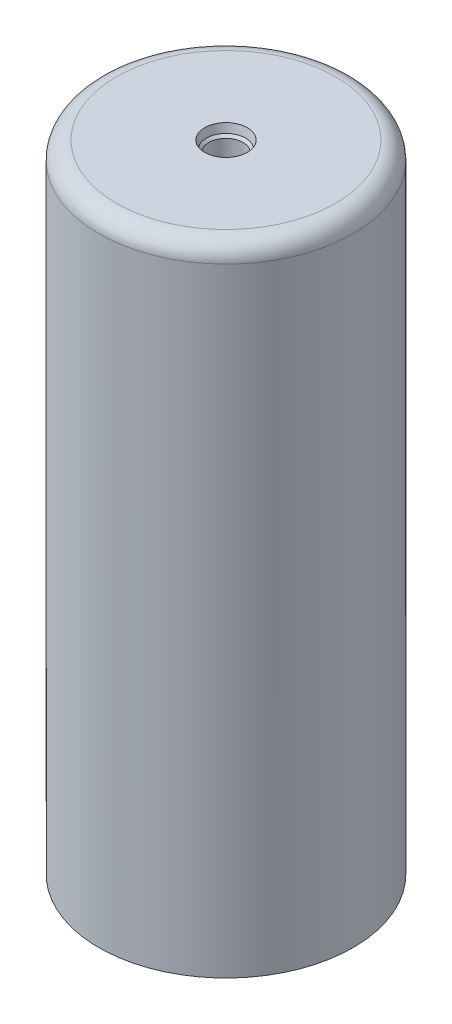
from build123d import *

# Parameters (mm, degrees)
FILLET1_R               = 5.08
CHAMFER1_SIZE           = 0.762
CHAMFER1_SIZE2          = 1.319822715
CUT_EXTRUDE1_REACH      = 193.374
CUT_EXTRUDE1_END_RADIUS = 36.83
CUT_EXTRUDE2_REACH      = 193.374
CUT_EXTRUDE2_END_RADIUS = 36.83


with BuildPart() as part:
    # Sketch1 → Revolve2 (revolve)
    with BuildSketch(Plane.XY, mode=Mode.PRIVATE) as revolve2_sk:
        Polygon((-33.147, 5.08), (-31.75, 6.477), (-31.75, 14.097), (-31.496, 14.351), (-31.496, 174.625), (0, 174.625), (0, 184.15), (-36.83, 184.15), (-36.83, 0), (-34.29, 0), (-33.147, 0), (-33.147, 2.159), (-33.782, 2.159), (-33.782, 4.191), (-33.147, 4.191), align=None)
    revolve(revolve2_sk.sketch.rotate(Axis((0, 0, 0), (0, 1, 0)), 270), axis=Axis((0, 0, 0), (0, 1, 0)))

    # Fillet1
    fillet1_edges = [part.edges().sort_by_distance(p)[0] for p in [
        (0, 184.15, 36.83),
        (0, 174.625, 31.496),
    ]]
    fillet(fillet1_edges, radius=FILLET1_R)

    # Chamfer1
    chamfer1_edges = [part.edges().sort_by_distance(p)[0] for p in [
        (0, 0, 33.147),
    ]]
    chamfer1_side = [part.faces().sort_by_distance(p)[0] for p in [
        (0, 0, 35.78829029),
    ]]
    chamfer(chamfer1_edges, length=CHAMFER1_SIZE, length2=CHAMFER1_SIZE2, reference=chamfer1_side[0])

    # Cut-Extrude1: up to this cylinder (the profile starts inside it)
    cut_extrude1_end = Plane(origin=(0, 3.124152, 0), z_dir=(0, -1, 0)) * Cylinder(CUT_EXTRUDE1_END_RADIUS, 461.408, mode=Mode.PRIVATE)
    # Sketch4 → Cut-Extrude1 (cut, up to the surface)
    with BuildSketch(Plane.XY, mode=Mode.PRIVATE) as cut_extrude1_sk1:
        with BuildLine():
            Line((-4.7625, 4.7117), (4.76504, 4.7117))
            ThreePointArc((4.76504, 4.7117), (5.885775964, 4.247475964), (6.35, 3.12674))
            Line((6.35, 3.12674), (6.35, 3.12166))
            ThreePointArc((6.35, 3.12166), (5.885775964, 2.000924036), (4.76504, 1.5367))
            Line((4.76504, 1.5367), (-3.503433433, 1.5367))
            Line((-3.503433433, 1.5367), (-4.76504, 1.5367))
            ThreePointArc((-4.76504, 1.5367), (-5.885775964, 2.000924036), (-6.35, 3.12166))
            Line((-6.35, 3.12166), (-6.35, 3.1242))
            ThreePointArc((-6.35, 3.1242), (-5.885032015, 4.246732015), (-4.7625, 4.7117))
        make_face()
    cut_extrude1_tool1 = extrude(cut_extrude1_sk1.sketch, amount=-CUT_EXTRUDE1_REACH, mode=Mode.PRIVATE) & cut_extrude1_end
    add(cut_extrude1_tool1.solids().sort_by_distance((0.000264, 3.124152, 0))[0], mode=Mode.SUBTRACT)

    # Cut-Extrude2: up to this cylinder (the profile starts inside it)
    cut_extrude2_end = Plane(origin=(0, 3.12166, 0), z_dir=(0, -1, 0)) * Cylinder(CUT_EXTRUDE2_END_RADIUS, 461.408, mode=Mode.PRIVATE)
    # Sketch5 → Cut-Extrude2 (cut, up to the surface)
    with BuildSketch(Plane(origin=(0, 0, 0), x_dir=(0, 0, -1), z_dir=(1, 0, 0)), mode=Mode.PRIVATE) as cut_extrude2_sk1:
        with BuildLine():
            Line((-4.76504, 4.70916), (4.76504, 4.70916))
            ThreePointArc((4.76504, 4.70916), (5.885775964, 4.244935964), (6.35, 3.1242))
            Line((6.35, 3.1242), (6.35, 3.11912))
            ThreePointArc((6.35, 3.11912), (5.885775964, 1.998384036), (4.76504, 1.53416))
            Line((4.76504, 1.53416), (-4.76504, 1.53416))
            ThreePointArc((-4.76504, 1.53416), (-5.885775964, 1.998384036), (-6.35, 3.11912))
            Line((-6.35, 3.11912), (-6.35, 3.1242))
            ThreePointArc((-6.35, 3.1242), (-5.885775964, 4.244935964), (-4.76504, 4.70916))
        make_face()
    cut_extrude2_tool1 = extrude(cut_extrude2_sk1.sketch, amount=-CUT_EXTRUDE2_REACH, mode=Mode.PRIVATE) & cut_extrude2_end
    add(cut_extrude2_tool1.solids().sort_by_distance((0, 3.12166, 0))[0], mode=Mode.SUBTRACT)

    # Sketch3 → SAE_4 (revolve, cut)
    with BuildSketch(Plane(origin=(0, 184.15, 0), x_dir=(0, 0, 1), z_dir=(1, 0, 0))):
        Polygon((0, 0), (0, 13.8938), (4.96062, 13.8938), (4.96062, 3.08437889), (5.68279889, 2.3622), (6.1849, 0), align=None)
    revolve(axis=Axis((0, 190.595314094, 0), (0, -1, 0)), mode=Mode.SUBTRACT)


solid = part.part
